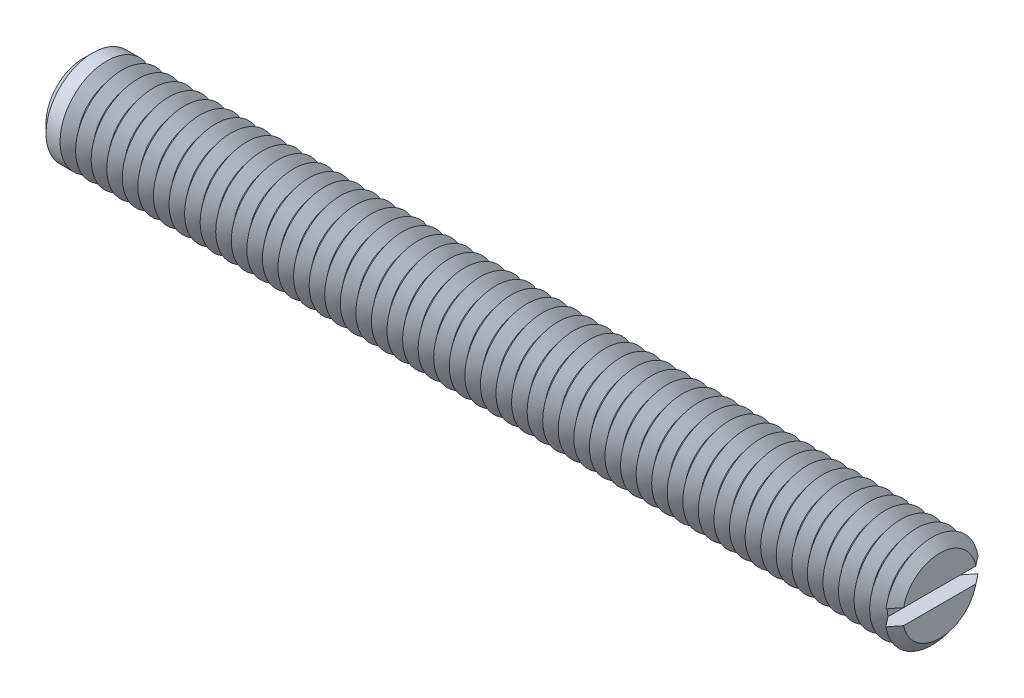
from build123d import *

# Parameters (mm, degrees)
SKETCH1_R       = 3
EXTRUDE1_DEPTH  = 27.5
SKETCH2_W       = 1
SKETCH2_H       = 1
EXTRUDE2_DEPTH  = 4.5
CHAMFER1_SIZE   = 0.6
LPATTERN1_COUNT = 54
LPATTERN1_PITCH = 1


with BuildPart() as part:
    # Sketch1 → Extrude1 (new, symmetric)
    with BuildSketch(Plane(origin=(0, 0, 0), x_dir=(0, 0, -1), z_dir=(1, 0, 0))):
        Circle(SKETCH1_R)
    extrude(amount=EXTRUDE1_DEPTH, both=True)

    # Sketch2 → Extrude2 (cut, symmetric)
    with BuildSketch(Plane.XY):
        with Locations((27, 0)):
            Rectangle(SKETCH2_W, SKETCH2_H)
    extrude(amount=EXTRUDE2_DEPTH, both=True, mode=Mode.SUBTRACT)

    # Chamfer1
    chamfer1_edges = [part.edges().sort_by_distance(p)[0] for p in [
        (-27.5, 0, 3),
    ]]
    chamfer(chamfer1_edges, length=CHAMFER1_SIZE)

    # Sketch3 → Cut-Revolve1 (revolve, cut)
    with BuildSketch(Plane.XY, mode=Mode.PRIVATE) as cut_revolve1_sk:
        Polygon((27, -3), (28, -3), (27.5, -2.3755002), align=None)
    cut_revolve1 = revolve(cut_revolve1_sk.sketch.rotate(Axis((0, 0, 0), (1, 0, 0)), 260.405931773), axis=Axis((0, 0, 0), (1, 0, 0)), mode=Mode.SUBTRACT)

    # LPattern1: Cut-Revolve1 ×54
    with Locations(*[(-i * LPATTERN1_PITCH, 0, 0) for i in range(1, LPATTERN1_COUNT)]):
        add(cut_revolve1, mode=Mode.SUBTRACT)


solid = part.part
